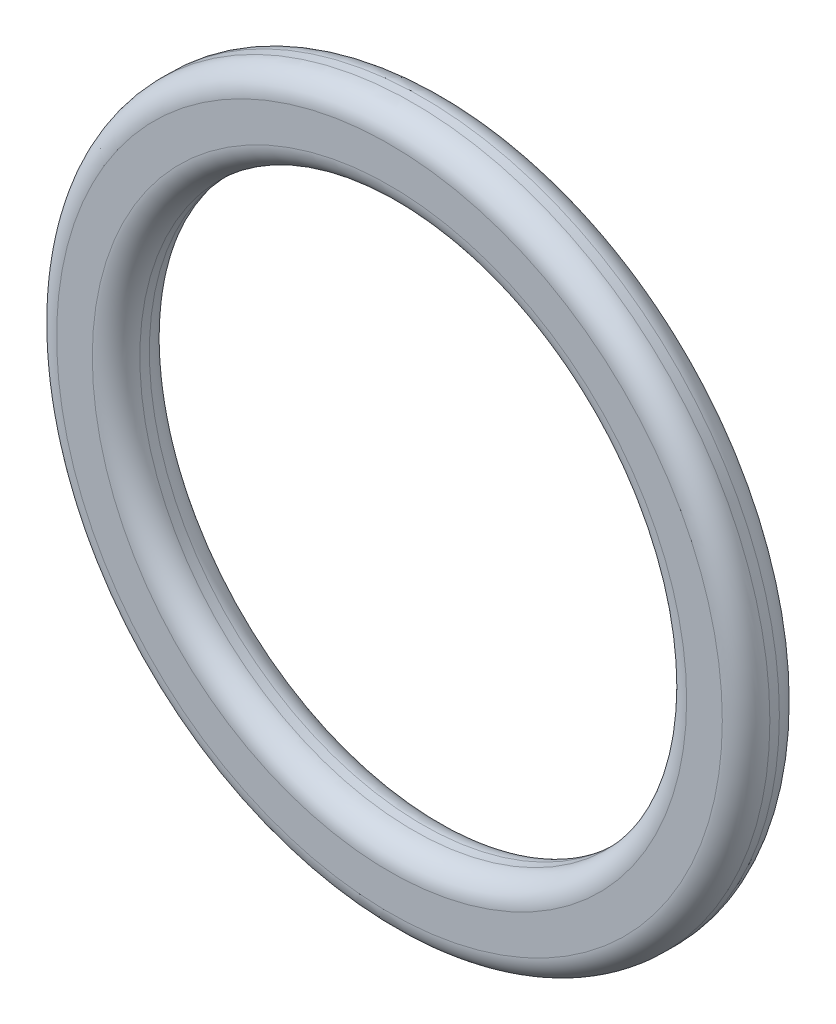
ISO-10303-21;
HEADER;
FILE_DESCRIPTION(('STEP AP214'),'2;1');
FILE_NAME('part.step','',(''),(''),'','','');
FILE_SCHEMA(('AUTOMOTIVE_DESIGN { 1 0 10303 214 1 1 1 1 }'));
ENDSEC;
DATA;
#1=APPLICATION_CONTEXT('core data for automotive mechanical design processes');
#2=APPLICATION_PROTOCOL_DEFINITION('international standard','automotive_design',2000,#1);
#3=PRODUCT_CONTEXT('',#1,'mechanical');
#4=PRODUCT('Part','Part','',(#3));
#5=PRODUCT_RELATED_PRODUCT_CATEGORY('part','',(#4));
#6=PRODUCT_DEFINITION_FORMATION('','',#4);
#7=PRODUCT_DEFINITION_CONTEXT('part definition',#1,'design');
#8=PRODUCT_DEFINITION('design','',#6,#7);
#9=PRODUCT_DEFINITION_SHAPE('','',#8);
#10=(LENGTH_UNIT() NAMED_UNIT(*) SI_UNIT(.MILLI.,.METRE.));
#11=(NAMED_UNIT(*) PLANE_ANGLE_UNIT() SI_UNIT($,.RADIAN.));
#12=(NAMED_UNIT(*) SI_UNIT($,.STERADIAN.) SOLID_ANGLE_UNIT());
#13=UNCERTAINTY_MEASURE_WITH_UNIT(LENGTH_MEASURE(1.E-05),#10,'distance_accuracy_value','');
#14=(GEOMETRIC_REPRESENTATION_CONTEXT(3) GLOBAL_UNCERTAINTY_ASSIGNED_CONTEXT((#13)) GLOBAL_UNIT_ASSIGNED_CONTEXT((#10,
#11,#12)) REPRESENTATION_CONTEXT('',''));
#15=CARTESIAN_POINT('',(0.,0.,0.));
#16=DIRECTION('',(0.,0.,1.));
#17=DIRECTION('',(1.,0.,0.));
#18=AXIS2_PLACEMENT_3D('',#15,#16,#17);
#19=CARTESIAN_POINT('',(0.,0.,-1.85936170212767));
#20=DIRECTION('',(0.,0.,1.));
#21=DIRECTION('',(1.,0.,0.));
#22=AXIS2_PLACEMENT_3D('',#19,#20,#21);
#23=TOROIDAL_SURFACE('',#22,12.5,1.);
#24=CARTESIAN_POINT('',(0.,0.,-2.85936170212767));
#25=DIRECTION('',(0.,0.,1.));
#26=DIRECTION('',(1.,0.,0.));
#27=AXIS2_PLACEMENT_3D('',#24,#25,#26);
#28=CIRCLE('',#27,12.5);
#29=CARTESIAN_POINT('',(12.5,0.,-2.85936170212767));
#30=VERTEX_POINT('',#29);
#31=EDGE_CURVE('E10',#30,#30,#28,.T.);
#32=ORIENTED_EDGE('',*,*,#31,.F.);
#33=EDGE_LOOP('',(#32));
#34=FACE_BOUND('',#33,.T.);
#35=CARTESIAN_POINT('',(0.,0.,-1.85936170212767));
#36=DIRECTION('',(0.,0.,1.));
#37=DIRECTION('',(1.,0.,0.));
#38=AXIS2_PLACEMENT_3D('',#35,#36,#37);
#39=CIRCLE('',#38,11.5);
#40=CARTESIAN_POINT('',(11.5,0.,-1.85936170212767));
#41=VERTEX_POINT('',#40);
#42=EDGE_CURVE('E56',#41,#41,#39,.T.);
#43=ORIENTED_EDGE('',*,*,#42,.T.);
#44=EDGE_LOOP('',(#43));
#45=FACE_BOUND('',#44,.T.);
#46=ADVANCED_FACE('F28',(#34,#45),#23,.T.);
#47=CARTESIAN_POINT('',(0.,14.,-2.85936170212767));
#48=DIRECTION('',(0.,0.,1.));
#49=DIRECTION('',(1.,0.,0.));
#50=AXIS2_PLACEMENT_3D('',#47,#48,#49);
#51=PLANE('',#50);
#52=CARTESIAN_POINT('',(0.,0.,-2.85936170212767));
#53=DIRECTION('',(0.,0.,1.));
#54=DIRECTION('',(1.,0.,0.));
#55=AXIS2_PLACEMENT_3D('',#52,#53,#54);
#56=CIRCLE('',#55,14.);
#57=CARTESIAN_POINT('',(14.,0.,-2.85936170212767));
#58=VERTEX_POINT('',#57);
#59=EDGE_CURVE('E34',#58,#58,#56,.T.);
#60=ORIENTED_EDGE('',*,*,#59,.F.);
#61=EDGE_LOOP('',(#60));
#62=FACE_BOUND('',#61,.T.);
#63=ORIENTED_EDGE('',*,*,#31,.T.);
#64=EDGE_LOOP('',(#63));
#65=FACE_BOUND('',#64,.T.);
#66=ADVANCED_FACE('F93',(#62,#65),#51,.F.);
#67=CARTESIAN_POINT('',(0.,0.,-1.85936170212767));
#68=DIRECTION('',(0.,0.,1.));
#69=DIRECTION('',(1.,0.,0.));
#70=AXIS2_PLACEMENT_3D('',#67,#68,#69);
#71=TOROIDAL_SURFACE('',#70,14.,1.);
#72=CARTESIAN_POINT('',(0.,0.,-1.85936170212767));
#73=DIRECTION('',(0.,0.,1.));
#74=DIRECTION('',(1.,0.,0.));
#75=AXIS2_PLACEMENT_3D('',#72,#73,#74);
#76=CIRCLE('',#75,15.);
#77=CARTESIAN_POINT('',(15.,0.,-1.85936170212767));
#78=VERTEX_POINT('',#77);
#79=EDGE_CURVE('E38',#78,#78,#76,.T.);
#80=ORIENTED_EDGE('',*,*,#79,.F.);
#81=EDGE_LOOP('',(#80));
#82=FACE_BOUND('',#81,.T.);
#83=ORIENTED_EDGE('',*,*,#59,.T.);
#84=EDGE_LOOP('',(#83));
#85=FACE_BOUND('',#84,.T.);
#86=ADVANCED_FACE('F88',(#82,#85),#71,.T.);
#87=CARTESIAN_POINT('',(0.,0.,20.8243971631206));
#88=DIRECTION('',(0.,0.,1.));
#89=DIRECTION('',(1.,0.,0.));
#90=AXIS2_PLACEMENT_3D('',#87,#88,#89);
#91=CYLINDRICAL_SURFACE('',#90,15.);
#92=CARTESIAN_POINT('',(0.,0.,-1.45936170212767));
#93=DIRECTION('',(0.,0.,1.));
#94=DIRECTION('',(1.,0.,0.));
#95=AXIS2_PLACEMENT_3D('',#92,#93,#94);
#96=CIRCLE('',#95,15.);
#97=CARTESIAN_POINT('',(15.,0.,-1.45936170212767));
#98=VERTEX_POINT('',#97);
#99=EDGE_CURVE('E42',#98,#98,#96,.T.);
#100=ORIENTED_EDGE('',*,*,#99,.F.);
#101=EDGE_LOOP('',(#100));
#102=FACE_BOUND('',#101,.T.);
#103=ORIENTED_EDGE('',*,*,#79,.T.);
#104=EDGE_LOOP('',(#103));
#105=FACE_BOUND('',#104,.T.);
#106=ADVANCED_FACE('F82',(#102,#105),#91,.T.);
#107=CARTESIAN_POINT('',(0.,0.,-1.45936170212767));
#108=DIRECTION('',(0.,0.,1.));
#109=DIRECTION('',(1.,0.,0.));
#110=AXIS2_PLACEMENT_3D('',#107,#108,#109);
#111=TOROIDAL_SURFACE('',#110,14.,1.);
#112=CARTESIAN_POINT('',(0.,0.,-0.459361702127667));
#113=DIRECTION('',(0.,0.,1.));
#114=DIRECTION('',(1.,0.,0.));
#115=AXIS2_PLACEMENT_3D('',#112,#113,#114);
#116=CIRCLE('',#115,14.);
#117=CARTESIAN_POINT('',(14.,0.,-0.459361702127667));
#118=VERTEX_POINT('',#117);
#119=EDGE_CURVE('E47',#118,#118,#116,.T.);
#120=ORIENTED_EDGE('',*,*,#119,.F.);
#121=EDGE_LOOP('',(#120));
#122=FACE_BOUND('',#121,.T.);
#123=ORIENTED_EDGE('',*,*,#99,.T.);
#124=EDGE_LOOP('',(#123));
#125=FACE_BOUND('',#124,.T.);
#126=ADVANCED_FACE('F76',(#122,#125),#111,.T.);
#127=CARTESIAN_POINT('',(0.,14.,-0.459361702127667));
#128=DIRECTION('',(0.,0.,-1.));
#129=DIRECTION('',(-1.,0.,0.));
#130=AXIS2_PLACEMENT_3D('',#127,#128,#129);
#131=PLANE('',#130);
#132=CARTESIAN_POINT('',(0.,0.,-0.459361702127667));
#133=DIRECTION('',(0.,0.,1.));
#134=DIRECTION('',(1.,0.,0.));
#135=AXIS2_PLACEMENT_3D('',#132,#133,#134);
#136=CIRCLE('',#135,12.5);
#137=CARTESIAN_POINT('',(12.5,0.,-0.459361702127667));
#138=VERTEX_POINT('',#137);
#139=EDGE_CURVE('E50',#138,#138,#136,.T.);
#140=ORIENTED_EDGE('',*,*,#139,.F.);
#141=EDGE_LOOP('',(#140));
#142=FACE_BOUND('',#141,.T.);
#143=ORIENTED_EDGE('',*,*,#119,.T.);
#144=EDGE_LOOP('',(#143));
#145=FACE_BOUND('',#144,.T.);
#146=ADVANCED_FACE('F70',(#142,#145),#131,.F.);
#147=CARTESIAN_POINT('',(0.,0.,-1.45936170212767));
#148=DIRECTION('',(0.,0.,1.));
#149=DIRECTION('',(1.,0.,0.));
#150=AXIS2_PLACEMENT_3D('',#147,#148,#149);
#151=TOROIDAL_SURFACE('',#150,12.5,1.);
#152=CARTESIAN_POINT('',(0.,0.,-1.45936170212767));
#153=DIRECTION('',(0.,0.,1.));
#154=DIRECTION('',(1.,0.,0.));
#155=AXIS2_PLACEMENT_3D('',#152,#153,#154);
#156=CIRCLE('',#155,11.5);
#157=CARTESIAN_POINT('',(11.5,0.,-1.45936170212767));
#158=VERTEX_POINT('',#157);
#159=EDGE_CURVE('E53',#158,#158,#156,.T.);
#160=ORIENTED_EDGE('',*,*,#159,.F.);
#161=EDGE_LOOP('',(#160));
#162=FACE_BOUND('',#161,.T.);
#163=ORIENTED_EDGE('',*,*,#139,.T.);
#164=EDGE_LOOP('',(#163));
#165=FACE_BOUND('',#164,.T.);
#166=ADVANCED_FACE('F64',(#162,#165),#151,.T.);
#167=CARTESIAN_POINT('',(0.,0.,20.8243971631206));
#168=DIRECTION('',(0.,0.,1.));
#169=DIRECTION('',(1.,0.,0.));
#170=AXIS2_PLACEMENT_3D('',#167,#168,#169);
#171=CYLINDRICAL_SURFACE('',#170,11.5);
#172=ORIENTED_EDGE('',*,*,#42,.F.);
#173=EDGE_LOOP('',(#172));
#174=FACE_BOUND('',#173,.T.);
#175=ORIENTED_EDGE('',*,*,#159,.T.);
#176=EDGE_LOOP('',(#175));
#177=FACE_BOUND('',#176,.T.);
#178=ADVANCED_FACE('F61',(#174,#177),#171,.F.);
#179=CLOSED_SHELL('',(#46,#66,#86,#106,#126,#146,#166,#178));
#180=MANIFOLD_SOLID_BREP('B2',#179);
#181=ADVANCED_BREP_SHAPE_REPRESENTATION('',(#18,#180),#14);
#182=SHAPE_DEFINITION_REPRESENTATION(#9,#181);
ENDSEC;
END-ISO-10303-21;
